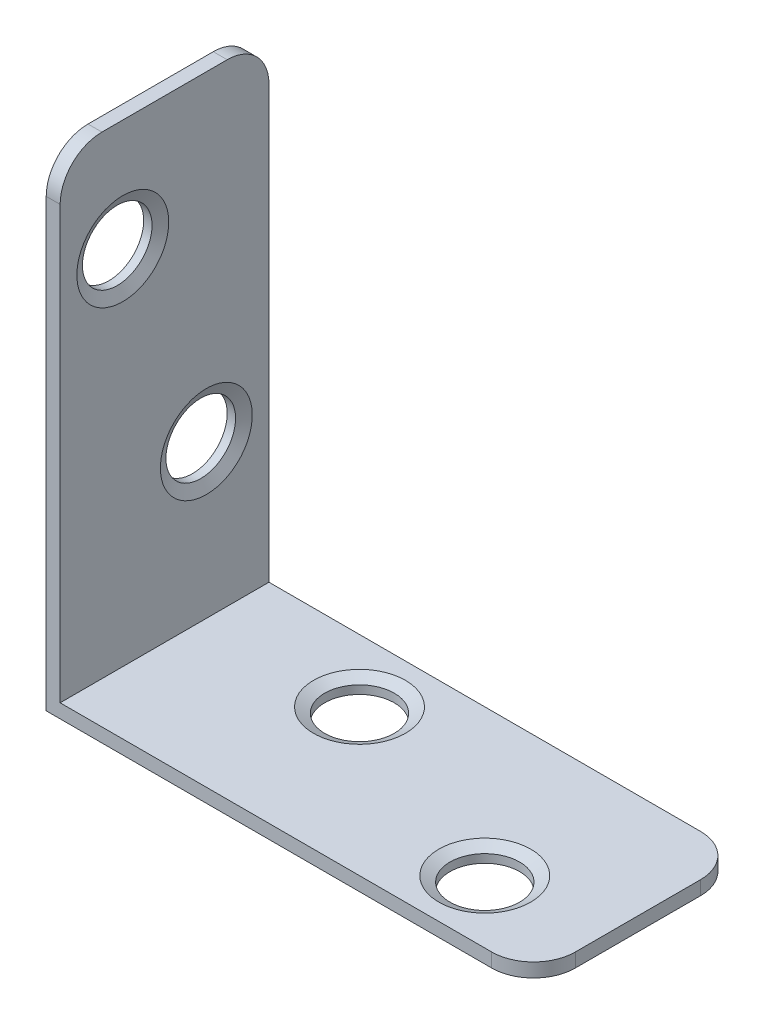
ISO-10303-21;
HEADER;
FILE_DESCRIPTION(('STEP AP214'),'2;1');
FILE_NAME('part.step','',(''),(''),'','','');
FILE_SCHEMA(('AUTOMOTIVE_DESIGN { 1 0 10303 214 1 1 1 1 }'));
ENDSEC;
DATA;
#1=APPLICATION_CONTEXT('core data for automotive mechanical design processes');
#2=APPLICATION_PROTOCOL_DEFINITION('international standard','automotive_design',2000,#1);
#3=PRODUCT_CONTEXT('',#1,'mechanical');
#4=PRODUCT('Part','Part','',(#3));
#5=PRODUCT_RELATED_PRODUCT_CATEGORY('part','',(#4));
#6=PRODUCT_DEFINITION_FORMATION('','',#4);
#7=PRODUCT_DEFINITION_CONTEXT('part definition',#1,'design');
#8=PRODUCT_DEFINITION('design','',#6,#7);
#9=PRODUCT_DEFINITION_SHAPE('','',#8);
#10=(LENGTH_UNIT() NAMED_UNIT(*) SI_UNIT(.MILLI.,.METRE.));
#11=(NAMED_UNIT(*) PLANE_ANGLE_UNIT() SI_UNIT($,.RADIAN.));
#12=(NAMED_UNIT(*) SI_UNIT($,.STERADIAN.) SOLID_ANGLE_UNIT());
#13=UNCERTAINTY_MEASURE_WITH_UNIT(LENGTH_MEASURE(1.E-05),#10,'distance_accuracy_value','');
#14=(GEOMETRIC_REPRESENTATION_CONTEXT(3) GLOBAL_UNCERTAINTY_ASSIGNED_CONTEXT((#13)) GLOBAL_UNIT_ASSIGNED_CONTEXT((#10,
#11,#12)) REPRESENTATION_CONTEXT('',''));
#15=CARTESIAN_POINT('',(0.,0.,0.));
#16=DIRECTION('',(0.,0.,1.));
#17=DIRECTION('',(1.,0.,0.));
#18=AXIS2_PLACEMENT_3D('',#15,#16,#17);
#19=CARTESIAN_POINT('',(35.,0.,7.5));
#20=DIRECTION('',(0.,1.,0.));
#21=DIRECTION('',(-1.,0.,0.));
#22=AXIS2_PLACEMENT_3D('',#19,#20,#21);
#23=PLANE('',#22);
#24=CARTESIAN_POINT('',(27.,-1.01481323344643E-13,3.));
#25=DIRECTION('',(0.,-1.,0.));
#26=DIRECTION('',(1.,0.,0.));
#27=AXIS2_PLACEMENT_3D('',#24,#25,#26);
#28=CIRCLE('',#27,2.5);
#29=CARTESIAN_POINT('',(29.5,-1.11776269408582E-13,3.));
#30=VERTEX_POINT('',#29);
#31=EDGE_CURVE('E284',#30,#30,#28,.T.);
#32=ORIENTED_EDGE('',*,*,#31,.F.);
#33=EDGE_LOOP('',(#32));
#34=FACE_BOUND('',#33,.T.);
#35=DIRECTION('',(1.,0.,0.));
#36=VECTOR('',#35,1.);
#37=CARTESIAN_POINT('',(35.,0.,-7.5));
#38=LINE('',#37,#36);
#39=CARTESIAN_POINT('',(0.,0.,-7.5));
#40=VERTEX_POINT('',#39);
#41=CARTESIAN_POINT('',(32.,0.,-7.5));
#42=VERTEX_POINT('',#41);
#43=EDGE_CURVE('E148',#40,#42,#38,.T.);
#44=ORIENTED_EDGE('',*,*,#43,.T.);
#45=CARTESIAN_POINT('',(32.,0.,-4.5));
#46=DIRECTION('',(0.,1.,0.));
#47=DIRECTION('',(-1.,0.,0.));
#48=AXIS2_PLACEMENT_3D('',#45,#46,#47);
#49=CIRCLE('',#48,3.);
#50=CARTESIAN_POINT('',(35.,0.,-4.5));
#51=VERTEX_POINT('',#50);
#52=EDGE_CURVE('E193',#42,#51,#49,.F.);
#53=ORIENTED_EDGE('',*,*,#52,.T.);
#54=DIRECTION('',(0.,0.,-1.));
#55=VECTOR('',#54,1.);
#56=CARTESIAN_POINT('',(35.,0.,7.5));
#57=LINE('',#56,#55);
#58=CARTESIAN_POINT('',(35.,0.,4.5));
#59=VERTEX_POINT('',#58);
#60=EDGE_CURVE('E165',#59,#51,#57,.T.);
#61=ORIENTED_EDGE('',*,*,#60,.F.);
#62=CARTESIAN_POINT('',(32.,0.,4.5));
#63=DIRECTION('',(0.,1.,0.));
#64=DIRECTION('',(-1.,0.,0.));
#65=AXIS2_PLACEMENT_3D('',#62,#63,#64);
#66=CIRCLE('',#65,3.);
#67=CARTESIAN_POINT('',(32.,0.,7.5));
#68=VERTEX_POINT('',#67);
#69=EDGE_CURVE('E50',#59,#68,#66,.F.);
#70=ORIENTED_EDGE('',*,*,#69,.T.);
#71=DIRECTION('',(1.,0.,0.));
#72=VECTOR('',#71,1.);
#73=CARTESIAN_POINT('',(35.,0.,7.5));
#74=LINE('',#73,#72);
#75=CARTESIAN_POINT('',(0.,0.,7.5));
#76=VERTEX_POINT('',#75);
#77=EDGE_CURVE('E124',#76,#68,#74,.T.);
#78=ORIENTED_EDGE('',*,*,#77,.F.);
#79=DIRECTION('',(0.,0.,-1.));
#80=VECTOR('',#79,1.);
#81=CARTESIAN_POINT('',(0.,0.,7.5));
#82=LINE('',#81,#80);
#83=EDGE_CURVE('E144',#76,#40,#82,.T.);
#84=ORIENTED_EDGE('',*,*,#83,.T.);
#85=EDGE_LOOP('',(#44,#53,#61,#70,#78,#84));
#86=FACE_BOUND('',#85,.T.);
#87=CARTESIAN_POINT('',(12.,0.,-3.));
#88=DIRECTION('',(0.,-1.,0.));
#89=DIRECTION('',(1.,0.,0.));
#90=AXIS2_PLACEMENT_3D('',#87,#88,#89);
#91=CIRCLE('',#90,2.5);
#92=CARTESIAN_POINT('',(14.5,0.,-3.));
#93=VERTEX_POINT('',#92);
#94=EDGE_CURVE('E289',#93,#93,#91,.T.);
#95=ORIENTED_EDGE('',*,*,#94,.F.);
#96=EDGE_LOOP('',(#95));
#97=FACE_BOUND('',#96,.T.);
#98=ADVANCED_FACE('F35',(#34,#86,#97),#23,.F.);
#99=CARTESIAN_POINT('',(1.,1.,7.5));
#100=DIRECTION('',(0.,-1.,0.));
#101=DIRECTION('',(0.,0.,-1.));
#102=AXIS2_PLACEMENT_3D('',#99,#100,#101);
#103=PLANE('',#102);
#104=CARTESIAN_POINT('',(27.,1.,3.));
#105=DIRECTION('',(0.,-1.,0.));
#106=DIRECTION('',(0.,0.,-1.));
#107=AXIS2_PLACEMENT_3D('',#104,#105,#106);
#108=CIRCLE('',#107,3.30000000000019);
#109=CARTESIAN_POINT('',(27.,1.,-0.300000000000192));
#110=VERTEX_POINT('',#109);
#111=EDGE_CURVE('E213',#110,#110,#108,.T.);
#112=ORIENTED_EDGE('',*,*,#111,.T.);
#113=EDGE_LOOP('',(#112));
#114=FACE_BOUND('',#113,.T.);
#115=CARTESIAN_POINT('',(12.,1.,-3.));
#116=DIRECTION('',(0.,-1.,0.));
#117=DIRECTION('',(0.,0.,-1.));
#118=AXIS2_PLACEMENT_3D('',#115,#116,#117);
#119=CIRCLE('',#118,3.30000000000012);
#120=CARTESIAN_POINT('',(12.,1.,-6.30000000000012));
#121=VERTEX_POINT('',#120);
#122=EDGE_CURVE('E210',#121,#121,#119,.T.);
#123=ORIENTED_EDGE('',*,*,#122,.T.);
#124=EDGE_LOOP('',(#123));
#125=FACE_BOUND('',#124,.T.);
#126=DIRECTION('',(0.,0.,-1.));
#127=VECTOR('',#126,1.);
#128=CARTESIAN_POINT('',(35.,1.,7.5));
#129=LINE('',#128,#127);
#130=CARTESIAN_POINT('',(35.,1.,4.5));
#131=VERTEX_POINT('',#130);
#132=CARTESIAN_POINT('',(35.,1.,-4.5));
#133=VERTEX_POINT('',#132);
#134=EDGE_CURVE('E135',#131,#133,#129,.T.);
#135=ORIENTED_EDGE('',*,*,#134,.T.);
#136=CARTESIAN_POINT('',(32.,1.,-4.5));
#137=DIRECTION('',(0.,-1.,0.));
#138=DIRECTION('',(0.,0.,-1.));
#139=AXIS2_PLACEMENT_3D('',#136,#137,#138);
#140=CIRCLE('',#139,3.);
#141=CARTESIAN_POINT('',(32.,1.,-7.5));
#142=VERTEX_POINT('',#141);
#143=EDGE_CURVE('E190',#133,#142,#140,.F.);
#144=ORIENTED_EDGE('',*,*,#143,.T.);
#145=DIRECTION('',(-1.,0.,0.));
#146=VECTOR('',#145,1.);
#147=CARTESIAN_POINT('',(1.,1.,-7.5));
#148=LINE('',#147,#146);
#149=CARTESIAN_POINT('',(1.,1.,-7.5));
#150=VERTEX_POINT('',#149);
#151=EDGE_CURVE('E131',#142,#150,#148,.T.);
#152=ORIENTED_EDGE('',*,*,#151,.T.);
#153=DIRECTION('',(0.,0.,-1.));
#154=VECTOR('',#153,1.);
#155=CARTESIAN_POINT('',(1.,1.,7.5));
#156=LINE('',#155,#154);
#157=CARTESIAN_POINT('',(1.,1.,7.5));
#158=VERTEX_POINT('',#157);
#159=EDGE_CURVE('E127',#158,#150,#156,.T.);
#160=ORIENTED_EDGE('',*,*,#159,.F.);
#161=DIRECTION('',(-1.,0.,0.));
#162=VECTOR('',#161,1.);
#163=CARTESIAN_POINT('',(1.,1.,7.5));
#164=LINE('',#163,#162);
#165=CARTESIAN_POINT('',(32.,1.,7.5));
#166=VERTEX_POINT('',#165);
#167=EDGE_CURVE('E115',#166,#158,#164,.T.);
#168=ORIENTED_EDGE('',*,*,#167,.F.);
#169=CARTESIAN_POINT('',(32.,1.,4.5));
#170=DIRECTION('',(0.,-1.,0.));
#171=DIRECTION('',(0.,0.,-1.));
#172=AXIS2_PLACEMENT_3D('',#169,#170,#171);
#173=CIRCLE('',#172,3.);
#174=EDGE_CURVE('E58',#166,#131,#173,.F.);
#175=ORIENTED_EDGE('',*,*,#174,.T.);
#176=EDGE_LOOP('',(#135,#144,#152,#160,#168,#175));
#177=FACE_BOUND('',#176,.T.);
#178=ADVANCED_FACE('F129',(#114,#125,#177),#103,.F.);
#179=CARTESIAN_POINT('',(35.,1.,7.5));
#180=DIRECTION('',(-1.,0.,0.));
#181=DIRECTION('',(0.,0.,1.));
#182=AXIS2_PLACEMENT_3D('',#179,#180,#181);
#183=PLANE('',#182);
#184=ORIENTED_EDGE('',*,*,#60,.T.);
#185=DIRECTION('',(0.,1.,0.));
#186=VECTOR('',#185,1.);
#187=CARTESIAN_POINT('',(35.,1.,-4.5));
#188=LINE('',#187,#186);
#189=EDGE_CURVE('E186',#51,#133,#188,.T.);
#190=ORIENTED_EDGE('',*,*,#189,.T.);
#191=ORIENTED_EDGE('',*,*,#134,.F.);
#192=DIRECTION('',(0.,1.,0.));
#193=VECTOR('',#192,1.);
#194=CARTESIAN_POINT('',(35.,1.,4.5));
#195=LINE('',#194,#193);
#196=EDGE_CURVE('E184',#131,#59,#195,.F.);
#197=ORIENTED_EDGE('',*,*,#196,.T.);
#198=EDGE_LOOP('',(#184,#190,#191,#197));
#199=FACE_BOUND('',#198,.T.);
#200=ADVANCED_FACE('F229',(#199),#183,.F.);
#201=CARTESIAN_POINT('',(1.,35.,7.5));
#202=DIRECTION('',(-1.,0.,0.));
#203=DIRECTION('',(0.,-1.,0.));
#204=AXIS2_PLACEMENT_3D('',#201,#202,#203);
#205=PLANE('',#204);
#206=CARTESIAN_POINT('',(1.,27.,3.));
#207=DIRECTION('',(-1.,0.,0.));
#208=DIRECTION('',(0.,-1.,0.));
#209=AXIS2_PLACEMENT_3D('',#206,#207,#208);
#210=CIRCLE('',#209,3.30000000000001);
#211=CARTESIAN_POINT('',(1.,27.,-0.300000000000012));
#212=VERTEX_POINT('',#211);
#213=EDGE_CURVE('E204',#212,#212,#210,.T.);
#214=ORIENTED_EDGE('',*,*,#213,.T.);
#215=EDGE_LOOP('',(#214));
#216=FACE_BOUND('',#215,.T.);
#217=CARTESIAN_POINT('',(1.,12.,-3.));
#218=DIRECTION('',(-1.,0.,0.));
#219=DIRECTION('',(0.,-1.,0.));
#220=AXIS2_PLACEMENT_3D('',#217,#218,#219);
#221=CIRCLE('',#220,3.30000000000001);
#222=CARTESIAN_POINT('',(1.,8.69999999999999,-3.));
#223=VERTEX_POINT('',#222);
#224=EDGE_CURVE('E201',#223,#223,#221,.T.);
#225=ORIENTED_EDGE('',*,*,#224,.T.);
#226=EDGE_LOOP('',(#225));
#227=FACE_BOUND('',#226,.T.);
#228=DIRECTION('',(0.,1.,0.));
#229=VECTOR('',#228,1.);
#230=CARTESIAN_POINT('',(1.,35.,-7.5));
#231=LINE('',#230,#229);
#232=CARTESIAN_POINT('',(1.,32.,-7.5));
#233=VERTEX_POINT('',#232);
#234=EDGE_CURVE('E153',#150,#233,#231,.T.);
#235=ORIENTED_EDGE('',*,*,#234,.T.);
#236=CARTESIAN_POINT('',(1.,32.,-4.5));
#237=DIRECTION('',(-1.,0.,0.));
#238=DIRECTION('',(0.,-1.,0.));
#239=AXIS2_PLACEMENT_3D('',#236,#237,#238);
#240=CIRCLE('',#239,3.);
#241=CARTESIAN_POINT('',(1.,35.,-4.5));
#242=VERTEX_POINT('',#241);
#243=EDGE_CURVE('E182',#233,#242,#240,.F.);
#244=ORIENTED_EDGE('',*,*,#243,.T.);
#245=DIRECTION('',(0.,0.,-1.));
#246=VECTOR('',#245,1.);
#247=CARTESIAN_POINT('',(1.,35.,7.5));
#248=LINE('',#247,#246);
#249=CARTESIAN_POINT('',(1.,35.,4.5));
#250=VERTEX_POINT('',#249);
#251=EDGE_CURVE('E136',#250,#242,#248,.T.);
#252=ORIENTED_EDGE('',*,*,#251,.F.);
#253=CARTESIAN_POINT('',(1.,32.,4.5));
#254=DIRECTION('',(-1.,0.,0.));
#255=DIRECTION('',(0.,-1.,0.));
#256=AXIS2_PLACEMENT_3D('',#253,#254,#255);
#257=CIRCLE('',#256,3.);
#258=CARTESIAN_POINT('',(1.,32.,7.5));
#259=VERTEX_POINT('',#258);
#260=EDGE_CURVE('E141',#250,#259,#257,.F.);
#261=ORIENTED_EDGE('',*,*,#260,.T.);
#262=DIRECTION('',(0.,1.,0.));
#263=VECTOR('',#262,1.);
#264=CARTESIAN_POINT('',(1.,35.,7.5));
#265=LINE('',#264,#263);
#266=EDGE_CURVE('E120',#158,#259,#265,.T.);
#267=ORIENTED_EDGE('',*,*,#266,.F.);
#268=ORIENTED_EDGE('',*,*,#159,.T.);
#269=EDGE_LOOP('',(#235,#244,#252,#261,#267,#268));
#270=FACE_BOUND('',#269,.T.);
#271=ADVANCED_FACE('F138',(#216,#227,#270),#205,.F.);
#272=CARTESIAN_POINT('',(0.,35.,7.5));
#273=DIRECTION('',(0.,-1.,0.));
#274=DIRECTION('',(0.,0.,-1.));
#275=AXIS2_PLACEMENT_3D('',#272,#273,#274);
#276=PLANE('',#275);
#277=ORIENTED_EDGE('',*,*,#251,.T.);
#278=DIRECTION('',(-1.,0.,0.));
#279=VECTOR('',#278,1.);
#280=CARTESIAN_POINT('',(0.,35.,-4.5));
#281=LINE('',#280,#279);
#282=CARTESIAN_POINT('',(0.,35.,-4.5));
#283=VERTEX_POINT('',#282);
#284=EDGE_CURVE('E170',#242,#283,#281,.T.);
#285=ORIENTED_EDGE('',*,*,#284,.T.);
#286=DIRECTION('',(0.,0.,-1.));
#287=VECTOR('',#286,1.);
#288=CARTESIAN_POINT('',(0.,35.,7.5));
#289=LINE('',#288,#287);
#290=CARTESIAN_POINT('',(0.,35.,4.5));
#291=VERTEX_POINT('',#290);
#292=EDGE_CURVE('E159',#291,#283,#289,.T.);
#293=ORIENTED_EDGE('',*,*,#292,.F.);
#294=DIRECTION('',(-1.,0.,0.));
#295=VECTOR('',#294,1.);
#296=CARTESIAN_POINT('',(0.,35.,4.5));
#297=LINE('',#296,#295);
#298=EDGE_CURVE('E168',#291,#250,#297,.F.);
#299=ORIENTED_EDGE('',*,*,#298,.T.);
#300=EDGE_LOOP('',(#277,#285,#293,#299));
#301=FACE_BOUND('',#300,.T.);
#302=ADVANCED_FACE('F308',(#301),#276,.F.);
#303=CARTESIAN_POINT('',(0.,0.,7.5));
#304=DIRECTION('',(1.,0.,0.));
#305=DIRECTION('',(0.,0.,-1.));
#306=AXIS2_PLACEMENT_3D('',#303,#304,#305);
#307=PLANE('',#306);
#308=CARTESIAN_POINT('',(0.,12.,-3.));
#309=DIRECTION('',(1.,0.,0.));
#310=DIRECTION('',(0.,1.,0.));
#311=AXIS2_PLACEMENT_3D('',#308,#309,#310);
#312=CIRCLE('',#311,2.5);
#313=CARTESIAN_POINT('',(0.,14.5,-3.));
#314=VERTEX_POINT('',#313);
#315=EDGE_CURVE('E282',#314,#314,#312,.T.);
#316=ORIENTED_EDGE('',*,*,#315,.T.);
#317=EDGE_LOOP('',(#316));
#318=FACE_BOUND('',#317,.T.);
#319=CARTESIAN_POINT('',(0.,27.,3.));
#320=DIRECTION('',(1.,0.,0.));
#321=DIRECTION('',(0.,1.,0.));
#322=AXIS2_PLACEMENT_3D('',#319,#320,#321);
#323=CIRCLE('',#322,2.5);
#324=CARTESIAN_POINT('',(0.,29.5,3.));
#325=VERTEX_POINT('',#324);
#326=EDGE_CURVE('E151',#325,#325,#323,.T.);
#327=ORIENTED_EDGE('',*,*,#326,.T.);
#328=EDGE_LOOP('',(#327));
#329=FACE_BOUND('',#328,.T.);
#330=ORIENTED_EDGE('',*,*,#292,.T.);
#331=CARTESIAN_POINT('',(0.,32.,-4.5));
#332=DIRECTION('',(1.,0.,0.));
#333=DIRECTION('',(0.,0.,-1.));
#334=AXIS2_PLACEMENT_3D('',#331,#332,#333);
#335=CIRCLE('',#334,3.);
#336=CARTESIAN_POINT('',(0.,32.,-7.5));
#337=VERTEX_POINT('',#336);
#338=EDGE_CURVE('E175',#283,#337,#335,.F.);
#339=ORIENTED_EDGE('',*,*,#338,.T.);
#340=DIRECTION('',(0.,-1.,0.));
#341=VECTOR('',#340,1.);
#342=CARTESIAN_POINT('',(0.,0.,-7.5));
#343=LINE('',#342,#341);
#344=EDGE_CURVE('E155',#337,#40,#343,.T.);
#345=ORIENTED_EDGE('',*,*,#344,.T.);
#346=ORIENTED_EDGE('',*,*,#83,.F.);
#347=DIRECTION('',(0.,-1.,0.));
#348=VECTOR('',#347,1.);
#349=CARTESIAN_POINT('',(0.,0.,7.5));
#350=LINE('',#349,#348);
#351=CARTESIAN_POINT('',(0.,32.,7.5));
#352=VERTEX_POINT('',#351);
#353=EDGE_CURVE('E142',#352,#76,#350,.T.);
#354=ORIENTED_EDGE('',*,*,#353,.F.);
#355=CARTESIAN_POINT('',(0.,32.,4.5));
#356=DIRECTION('',(1.,0.,0.));
#357=DIRECTION('',(0.,0.,-1.));
#358=AXIS2_PLACEMENT_3D('',#355,#356,#357);
#359=CIRCLE('',#358,3.);
#360=EDGE_CURVE('E173',#352,#291,#359,.F.);
#361=ORIENTED_EDGE('',*,*,#360,.T.);
#362=EDGE_LOOP('',(#330,#339,#345,#346,#354,#361));
#363=FACE_BOUND('',#362,.T.);
#364=ADVANCED_FACE('F311',(#318,#329,#363),#307,.F.);
#365=CARTESIAN_POINT('',(0.,0.,7.5));
#366=DIRECTION('',(0.,0.,-1.));
#367=DIRECTION('',(-1.,0.,0.));
#368=AXIS2_PLACEMENT_3D('',#365,#366,#367);
#369=PLANE('',#368);
#370=ORIENTED_EDGE('',*,*,#266,.T.);
#371=DIRECTION('',(-1.,0.,0.));
#372=VECTOR('',#371,1.);
#373=CARTESIAN_POINT('',(0.,32.,7.5));
#374=LINE('',#373,#372);
#375=EDGE_CURVE('E196',#259,#352,#374,.T.);
#376=ORIENTED_EDGE('',*,*,#375,.T.);
#377=ORIENTED_EDGE('',*,*,#353,.T.);
#378=ORIENTED_EDGE('',*,*,#77,.T.);
#379=DIRECTION('',(0.,1.,0.));
#380=VECTOR('',#379,1.);
#381=CARTESIAN_POINT('',(32.,0.,7.5));
#382=LINE('',#381,#380);
#383=EDGE_CURVE('E122',#68,#166,#382,.T.);
#384=ORIENTED_EDGE('',*,*,#383,.T.);
#385=ORIENTED_EDGE('',*,*,#167,.T.);
#386=EDGE_LOOP('',(#370,#376,#377,#378,#384,#385));
#387=FACE_BOUND('',#386,.T.);
#388=ADVANCED_FACE('F117',(#387),#369,.F.);
#389=CARTESIAN_POINT('',(0.,0.,-7.5));
#390=DIRECTION('',(0.,0.,-1.));
#391=DIRECTION('',(-1.,0.,0.));
#392=AXIS2_PLACEMENT_3D('',#389,#390,#391);
#393=PLANE('',#392);
#394=ORIENTED_EDGE('',*,*,#344,.F.);
#395=DIRECTION('',(-1.,0.,0.));
#396=VECTOR('',#395,1.);
#397=CARTESIAN_POINT('',(1.,32.,-7.5));
#398=LINE('',#397,#396);
#399=EDGE_CURVE('E179',#337,#233,#398,.F.);
#400=ORIENTED_EDGE('',*,*,#399,.T.);
#401=ORIENTED_EDGE('',*,*,#234,.F.);
#402=ORIENTED_EDGE('',*,*,#151,.F.);
#403=DIRECTION('',(0.,1.,0.));
#404=VECTOR('',#403,1.);
#405=CARTESIAN_POINT('',(32.,0.,-7.5));
#406=LINE('',#405,#404);
#407=EDGE_CURVE('E177',#142,#42,#406,.F.);
#408=ORIENTED_EDGE('',*,*,#407,.T.);
#409=ORIENTED_EDGE('',*,*,#43,.F.);
#410=EDGE_LOOP('',(#394,#400,#401,#402,#408,#409));
#411=FACE_BOUND('',#410,.T.);
#412=ADVANCED_FACE('F250',(#411),#393,.T.);
#413=CARTESIAN_POINT('',(0.,32.,-4.5));
#414=DIRECTION('',(1.,0.,0.));
#415=DIRECTION('',(0.,0.,-1.));
#416=AXIS2_PLACEMENT_3D('',#413,#414,#415);
#417=CYLINDRICAL_SURFACE('',#416,3.);
#418=ORIENTED_EDGE('',*,*,#243,.F.);
#419=ORIENTED_EDGE('',*,*,#399,.F.);
#420=ORIENTED_EDGE('',*,*,#338,.F.);
#421=ORIENTED_EDGE('',*,*,#284,.F.);
#422=EDGE_LOOP('',(#418,#419,#420,#421));
#423=FACE_BOUND('',#422,.T.);
#424=ADVANCED_FACE('F246',(#423),#417,.T.);
#425=CARTESIAN_POINT('',(32.,1.,-4.5));
#426=DIRECTION('',(0.,-1.,0.));
#427=DIRECTION('',(0.,0.,-1.));
#428=AXIS2_PLACEMENT_3D('',#425,#426,#427);
#429=CYLINDRICAL_SURFACE('',#428,3.);
#430=ORIENTED_EDGE('',*,*,#52,.F.);
#431=ORIENTED_EDGE('',*,*,#407,.F.);
#432=ORIENTED_EDGE('',*,*,#143,.F.);
#433=ORIENTED_EDGE('',*,*,#189,.F.);
#434=EDGE_LOOP('',(#430,#431,#432,#433));
#435=FACE_BOUND('',#434,.T.);
#436=ADVANCED_FACE('F249',(#435),#429,.T.);
#437=CARTESIAN_POINT('',(0.,32.,4.5));
#438=DIRECTION('',(-1.,0.,0.));
#439=DIRECTION('',(0.,0.,1.));
#440=AXIS2_PLACEMENT_3D('',#437,#438,#439);
#441=CYLINDRICAL_SURFACE('',#440,3.);
#442=ORIENTED_EDGE('',*,*,#260,.F.);
#443=ORIENTED_EDGE('',*,*,#298,.F.);
#444=ORIENTED_EDGE('',*,*,#360,.F.);
#445=ORIENTED_EDGE('',*,*,#375,.F.);
#446=EDGE_LOOP('',(#442,#443,#444,#445));
#447=FACE_BOUND('',#446,.T.);
#448=ADVANCED_FACE('F254',(#447),#441,.T.);
#449=CARTESIAN_POINT('',(32.,0.,4.5));
#450=DIRECTION('',(0.,1.,0.));
#451=DIRECTION('',(0.,0.,1.));
#452=AXIS2_PLACEMENT_3D('',#449,#450,#451);
#453=CYLINDRICAL_SURFACE('',#452,3.);
#454=ORIENTED_EDGE('',*,*,#69,.F.);
#455=ORIENTED_EDGE('',*,*,#196,.F.);
#456=ORIENTED_EDGE('',*,*,#174,.F.);
#457=ORIENTED_EDGE('',*,*,#383,.F.);
#458=EDGE_LOOP('',(#454,#455,#456,#457));
#459=FACE_BOUND('',#458,.T.);
#460=ADVANCED_FACE('F258',(#459),#453,.T.);
#461=CARTESIAN_POINT('',(0.,27.,3.));
#462=DIRECTION('',(1.,0.,0.));
#463=DIRECTION('',(0.,1.,0.));
#464=AXIS2_PLACEMENT_3D('',#461,#462,#463);
#465=CYLINDRICAL_SURFACE('',#464,2.5);
#466=CARTESIAN_POINT('',(0.599999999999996,27.,3.));
#467=DIRECTION('',(-1.,0.,0.));
#468=DIRECTION('',(0.,0.,1.));
#469=AXIS2_PLACEMENT_3D('',#466,#467,#468);
#470=CIRCLE('',#469,2.5);
#471=CARTESIAN_POINT('',(0.599999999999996,27.,0.499999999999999));
#472=VERTEX_POINT('',#471);
#473=EDGE_CURVE('E198',#472,#472,#470,.F.);
#474=ORIENTED_EDGE('',*,*,#473,.T.);
#475=EDGE_LOOP('',(#474));
#476=FACE_BOUND('',#475,.T.);
#477=ORIENTED_EDGE('',*,*,#326,.F.);
#478=EDGE_LOOP('',(#477));
#479=FACE_BOUND('',#478,.T.);
#480=ADVANCED_FACE('F262',(#476,#479),#465,.F.);
#481=CARTESIAN_POINT('',(0.,12.,-3.));
#482=DIRECTION('',(1.,0.,0.));
#483=DIRECTION('',(0.,1.,0.));
#484=AXIS2_PLACEMENT_3D('',#481,#482,#483);
#485=CYLINDRICAL_SURFACE('',#484,2.5);
#486=CARTESIAN_POINT('',(0.599999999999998,12.,-3.));
#487=DIRECTION('',(-1.,0.,0.));
#488=DIRECTION('',(0.,0.,1.));
#489=AXIS2_PLACEMENT_3D('',#486,#487,#488);
#490=CIRCLE('',#489,2.5);
#491=CARTESIAN_POINT('',(0.599999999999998,12.,-0.500000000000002));
#492=VERTEX_POINT('',#491);
#493=EDGE_CURVE('E207',#492,#492,#490,.F.);
#494=ORIENTED_EDGE('',*,*,#493,.T.);
#495=EDGE_LOOP('',(#494));
#496=FACE_BOUND('',#495,.T.);
#497=ORIENTED_EDGE('',*,*,#315,.F.);
#498=EDGE_LOOP('',(#497));
#499=FACE_BOUND('',#498,.T.);
#500=ADVANCED_FACE('F276',(#496,#499),#485,.F.);
#501=CARTESIAN_POINT('',(27.,-1.01481323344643E-13,3.));
#502=DIRECTION('',(0.,1.,0.));
#503=DIRECTION('',(-1.,0.,0.));
#504=AXIS2_PLACEMENT_3D('',#501,#502,#503);
#505=CYLINDRICAL_SURFACE('',#504,2.5);
#506=CARTESIAN_POINT('',(27.,0.599999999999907,3.));
#507=DIRECTION('',(0.,-1.,0.));
#508=DIRECTION('',(0.,0.,-1.));
#509=AXIS2_PLACEMENT_3D('',#506,#507,#508);
#510=CIRCLE('',#509,2.5);
#511=CARTESIAN_POINT('',(27.,0.599999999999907,0.499999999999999));
#512=VERTEX_POINT('',#511);
#513=EDGE_CURVE('E43',#512,#512,#510,.F.);
#514=ORIENTED_EDGE('',*,*,#513,.T.);
#515=EDGE_LOOP('',(#514));
#516=FACE_BOUND('',#515,.T.);
#517=ORIENTED_EDGE('',*,*,#31,.T.);
#518=EDGE_LOOP('',(#517));
#519=FACE_BOUND('',#518,.T.);
#520=ADVANCED_FACE('F218',(#516,#519),#505,.F.);
#521=CARTESIAN_POINT('',(12.,0.,-3.));
#522=DIRECTION('',(0.,1.,0.));
#523=DIRECTION('',(-1.,0.,0.));
#524=AXIS2_PLACEMENT_3D('',#521,#522,#523);
#525=CYLINDRICAL_SURFACE('',#524,2.5);
#526=CARTESIAN_POINT('',(12.,0.599999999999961,-3.));
#527=DIRECTION('',(0.,-1.,0.));
#528=DIRECTION('',(1.,0.,0.));
#529=AXIS2_PLACEMENT_3D('',#526,#527,#528);
#530=CIRCLE('',#529,2.5);
#531=CARTESIAN_POINT('',(14.5,0.59999999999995,-3.));
#532=VERTEX_POINT('',#531);
#533=EDGE_CURVE('E11',#532,#532,#530,.F.);
#534=ORIENTED_EDGE('',*,*,#533,.T.);
#535=EDGE_LOOP('',(#534));
#536=FACE_BOUND('',#535,.T.);
#537=ORIENTED_EDGE('',*,*,#94,.T.);
#538=EDGE_LOOP('',(#537));
#539=FACE_BOUND('',#538,.T.);
#540=ADVANCED_FACE('F266',(#536,#539),#525,.F.);
#541=CARTESIAN_POINT('',(0.599999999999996,27.,3.));
#542=DIRECTION('',(1.,0.,0.));
#543=DIRECTION('',(0.,0.,-1.));
#544=AXIS2_PLACEMENT_3D('',#541,#542,#543);
#545=CONICAL_SURFACE('',#544,2.5,1.10714871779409);
#546=CARTESIAN_POINT('',(1.,27.,-0.300000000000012));
#547=CARTESIAN_POINT('',(0.995833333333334,27.,-0.291666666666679));
#548=CARTESIAN_POINT('',(0.991666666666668,27.,-0.283333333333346));
#549=CARTESIAN_POINT('',(0.983333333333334,27.,-0.266666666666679));
#550=CARTESIAN_POINT('',(0.979166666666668,27.,-0.258333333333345));
#551=CARTESIAN_POINT('',(0.970833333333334,27.,-0.241666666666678));
#552=CARTESIAN_POINT('',(0.966666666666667,27.,-0.233333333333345));
#553=CARTESIAN_POINT('',(0.958333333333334,27.,-0.216666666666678));
#554=CARTESIAN_POINT('',(0.954166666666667,27.,-0.208333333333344));
#555=CARTESIAN_POINT('',(0.945833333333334,27.,-0.191666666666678));
#556=CARTESIAN_POINT('',(0.941666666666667,27.,-0.183333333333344));
#557=CARTESIAN_POINT('',(0.933333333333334,27.,-0.166666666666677));
#558=CARTESIAN_POINT('',(0.929166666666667,27.,-0.158333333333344));
#559=CARTESIAN_POINT('',(0.920833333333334,27.,-0.141666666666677));
#560=CARTESIAN_POINT('',(0.916666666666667,27.,-0.133333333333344));
#561=CARTESIAN_POINT('',(0.908333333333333,27.,-0.116666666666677));
#562=CARTESIAN_POINT('',(0.904166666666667,27.,-0.108333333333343));
#563=CARTESIAN_POINT('',(0.895833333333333,27.,-0.0916666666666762));
#564=CARTESIAN_POINT('',(0.891666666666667,27.,-0.0833333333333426));
#565=CARTESIAN_POINT('',(0.883333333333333,27.,-0.0666666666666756));
#566=CARTESIAN_POINT('',(0.879166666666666,27.,-0.0583333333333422));
#567=CARTESIAN_POINT('',(0.870833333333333,27.,-0.0416666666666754));
#568=CARTESIAN_POINT('',(0.866666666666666,27.,-0.033333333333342));
#569=CARTESIAN_POINT('',(0.858333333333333,27.,-0.0166666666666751));
#570=CARTESIAN_POINT('',(0.854166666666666,27.,-0.00833333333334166));
#571=CARTESIAN_POINT('',(0.845833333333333,27.,0.00833333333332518));
#572=CARTESIAN_POINT('',(0.841666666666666,27.,0.0166666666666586));
#573=CARTESIAN_POINT('',(0.833333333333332,27.,0.0333333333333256));
#574=CARTESIAN_POINT('',(0.829166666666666,27.,0.0416666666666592));
#575=CARTESIAN_POINT('',(0.820833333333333,27.,0.0583333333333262));
#576=CARTESIAN_POINT('',(0.816666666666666,27.,0.0666666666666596));
#577=CARTESIAN_POINT('',(0.808333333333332,27.,0.0833333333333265));
#578=CARTESIAN_POINT('',(0.804166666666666,27.,0.0916666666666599));
#579=CARTESIAN_POINT('',(0.795833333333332,27.,0.108333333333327));
#580=CARTESIAN_POINT('',(0.791666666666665,27.,0.11666666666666));
#581=CARTESIAN_POINT('',(0.783333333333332,27.,0.133333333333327));
#582=CARTESIAN_POINT('',(0.779166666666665,27.,0.14166666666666));
#583=CARTESIAN_POINT('',(0.770833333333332,27.,0.158333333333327));
#584=CARTESIAN_POINT('',(0.766666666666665,27.,0.166666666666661));
#585=CARTESIAN_POINT('',(0.758333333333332,27.,0.183333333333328));
#586=CARTESIAN_POINT('',(0.754166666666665,27.,0.191666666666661));
#587=CARTESIAN_POINT('',(0.745833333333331,27.,0.208333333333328));
#588=CARTESIAN_POINT('',(0.741666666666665,27.,0.216666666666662));
#589=CARTESIAN_POINT('',(0.733333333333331,27.,0.233333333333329));
#590=CARTESIAN_POINT('',(0.729166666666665,27.,0.241666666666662));
#591=CARTESIAN_POINT('',(0.720833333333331,27.,0.258333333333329));
#592=CARTESIAN_POINT('',(0.716666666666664,27.,0.266666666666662));
#593=CARTESIAN_POINT('',(0.708333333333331,27.,0.283333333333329));
#594=CARTESIAN_POINT('',(0.704166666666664,27.,0.291666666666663));
#595=CARTESIAN_POINT('',(0.695833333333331,27.,0.30833333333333));
#596=CARTESIAN_POINT('',(0.691666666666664,27.,0.316666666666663));
#597=CARTESIAN_POINT('',(0.683333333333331,27.,0.33333333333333));
#598=CARTESIAN_POINT('',(0.679166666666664,27.,0.341666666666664));
#599=CARTESIAN_POINT('',(0.670833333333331,27.,0.35833333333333));
#600=CARTESIAN_POINT('',(0.666666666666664,27.,0.366666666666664));
#601=CARTESIAN_POINT('',(0.65833333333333,27.,0.383333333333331));
#602=CARTESIAN_POINT('',(0.654166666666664,27.,0.391666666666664));
#603=CARTESIAN_POINT('',(0.64583333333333,27.,0.408333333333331));
#604=CARTESIAN_POINT('',(0.641666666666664,27.,0.416666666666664));
#605=CARTESIAN_POINT('',(0.63333333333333,27.,0.433333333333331));
#606=CARTESIAN_POINT('',(0.629166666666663,27.,0.441666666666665));
#607=CARTESIAN_POINT('',(0.62083333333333,27.,0.458333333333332));
#608=CARTESIAN_POINT('',(0.616666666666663,27.,0.466666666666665));
#609=CARTESIAN_POINT('',(0.60833333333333,27.,0.483333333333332));
#610=CARTESIAN_POINT('',(0.604166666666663,27.,0.491666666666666));
#611=CARTESIAN_POINT('',(0.599999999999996,27.,0.499999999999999));
#612=B_SPLINE_CURVE_WITH_KNOTS('',3,(#546,#547,#548,#549,#550,#551,#552,#553,#554,#555,#556,
#557,#558,#559,#560,#561,#562,#563,#564,#565,#566,#567,#568,#569,#570,#571,#572,#573,#574,#575,
#576,#577,#578,#579,#580,#581,#582,#583,#584,#585,#586,#587,#588,#589,#590,#591,#592,#593,#594,
#595,#596,#597,#598,#599,#600,#601,#602,#603,#604,#605,#606,#607,#608,#609,#610,#611),
.UNSPECIFIED.,.F.,.F.,(4,2,2,2,2,2,2,2,2,2,2,2,2,2,2,2,2,2,2,2,2,2,2,2,2,2,2,2,2,2,2,2,4),(0.,
0.0279508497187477,0.0559016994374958,0.0838525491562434,0.111803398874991,0.139754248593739,
0.167705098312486,0.195655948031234,0.223606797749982,0.25155764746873,0.279508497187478,
0.307459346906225,0.335410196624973,0.363361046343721,0.391311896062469,0.419262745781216,
0.447213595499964,0.475164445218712,0.503115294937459,0.531066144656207,0.559016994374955,
0.586967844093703,0.614918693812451,0.642869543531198,0.670820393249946,0.698771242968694,
0.726722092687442,0.75467294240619,0.782623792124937,0.810574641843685,0.838525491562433,
0.866476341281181,0.894427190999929),.UNSPECIFIED.);
#613=EDGE_CURVE('BSEAM263',#212,#472,#612,.T.);
#614=ORIENTED_EDGE('',*,*,#213,.F.);
#615=ORIENTED_EDGE('',*,*,#473,.F.);
#616=ORIENTED_EDGE('',*,*,#613,.T.);
#617=ORIENTED_EDGE('',*,*,#613,.F.);
#618=EDGE_LOOP('',(#614,#616,#615,#617));
#619=FACE_BOUND('',#618,.T.);
#620=ADVANCED_FACE('F263',(#619),#545,.F.);
#621=CARTESIAN_POINT('',(0.599999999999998,12.,-3.));
#622=DIRECTION('',(1.,0.,0.));
#623=DIRECTION('',(0.,0.,-1.));
#624=AXIS2_PLACEMENT_3D('',#621,#622,#623);
#625=CONICAL_SURFACE('',#624,2.5,1.10714871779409);
#626=ORIENTED_EDGE('',*,*,#224,.F.);
#627=EDGE_LOOP('',(#626));
#628=FACE_BOUND('',#627,.T.);
#629=ORIENTED_EDGE('',*,*,#493,.F.);
#630=EDGE_LOOP('',(#629));
#631=FACE_BOUND('',#630,.T.);
#632=ADVANCED_FACE('F224',(#628,#631),#625,.F.);
#633=CARTESIAN_POINT('',(27.,1.,3.));
#634=DIRECTION('',(0.,1.,0.));
#635=DIRECTION('',(0.,0.,1.));
#636=AXIS2_PLACEMENT_3D('',#633,#634,#635);
#637=CONICAL_SURFACE('',#636,3.30000000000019,1.10714871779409);
#638=ORIENTED_EDGE('',*,*,#513,.F.);
#639=EDGE_LOOP('',(#638));
#640=FACE_BOUND('',#639,.T.);
#641=ORIENTED_EDGE('',*,*,#111,.F.);
#642=EDGE_LOOP('',(#641));
#643=FACE_BOUND('',#642,.T.);
#644=ADVANCED_FACE('F221',(#640,#643),#637,.F.);
#645=CARTESIAN_POINT('',(12.,1.,-3.));
#646=DIRECTION('',(0.,1.,0.));
#647=DIRECTION('',(-1.,0.,0.));
#648=AXIS2_PLACEMENT_3D('',#645,#646,#647);
#649=CONICAL_SURFACE('',#648,3.30000000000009,1.10714871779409);
#650=ORIENTED_EDGE('',*,*,#533,.F.);
#651=EDGE_LOOP('',(#650));
#652=FACE_BOUND('',#651,.T.);
#653=ORIENTED_EDGE('',*,*,#122,.F.);
#654=EDGE_LOOP('',(#653));
#655=FACE_BOUND('',#654,.T.);
#656=ADVANCED_FACE('F37',(#652,#655),#649,.F.);
#657=CLOSED_SHELL('',(#98,#178,#200,#271,#302,#364,#388,#412,#424,#436,#448,#460,#480,#500,#520,
#540,#620,#632,#644,#656));
#658=MANIFOLD_SOLID_BREP('B2',#657);
#659=ADVANCED_BREP_SHAPE_REPRESENTATION('',(#18,#658),#14);
#660=SHAPE_DEFINITION_REPRESENTATION(#9,#659);
ENDSEC;
END-ISO-10303-21;
